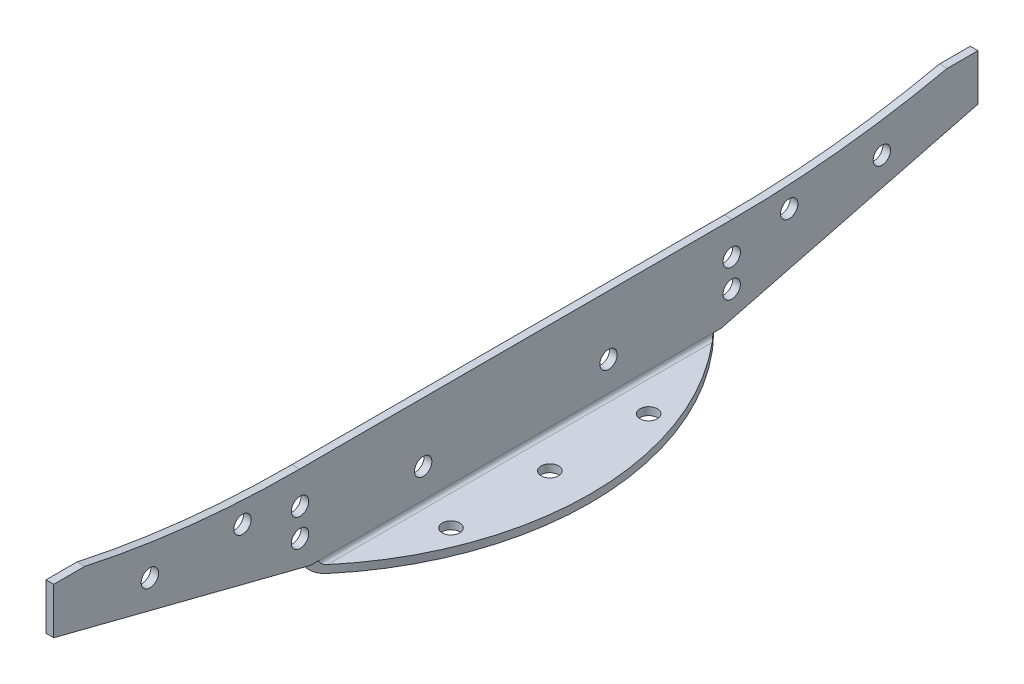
ISO-10303-21;
HEADER;
FILE_DESCRIPTION(('STEP AP214'),'2;1');
FILE_NAME('part.step','',(''),(''),'','','');
FILE_SCHEMA(('AUTOMOTIVE_DESIGN { 1 0 10303 214 1 1 1 1 }'));
ENDSEC;
DATA;
#1=APPLICATION_CONTEXT('core data for automotive mechanical design processes');
#2=APPLICATION_PROTOCOL_DEFINITION('international standard','automotive_design',2000,#1);
#3=PRODUCT_CONTEXT('',#1,'mechanical');
#4=PRODUCT('Part','Part','',(#3));
#5=PRODUCT_RELATED_PRODUCT_CATEGORY('part','',(#4));
#6=PRODUCT_DEFINITION_FORMATION('','',#4);
#7=PRODUCT_DEFINITION_CONTEXT('part definition',#1,'design');
#8=PRODUCT_DEFINITION('design','',#6,#7);
#9=PRODUCT_DEFINITION_SHAPE('','',#8);
#10=(LENGTH_UNIT() NAMED_UNIT(*) SI_UNIT(.MILLI.,.METRE.));
#11=(NAMED_UNIT(*) PLANE_ANGLE_UNIT() SI_UNIT($,.RADIAN.));
#12=(NAMED_UNIT(*) SI_UNIT($,.STERADIAN.) SOLID_ANGLE_UNIT());
#13=UNCERTAINTY_MEASURE_WITH_UNIT(LENGTH_MEASURE(1.E-05),#10,'distance_accuracy_value','');
#14=(GEOMETRIC_REPRESENTATION_CONTEXT(3) GLOBAL_UNCERTAINTY_ASSIGNED_CONTEXT((#13)) GLOBAL_UNIT_ASSIGNED_CONTEXT((#10,
#11,#12)) REPRESENTATION_CONTEXT('',''));
#15=CARTESIAN_POINT('',(0.,0.,0.));
#16=DIRECTION('',(0.,0.,1.));
#17=DIRECTION('',(1.,0.,0.));
#18=AXIS2_PLACEMENT_3D('',#15,#16,#17);
#19=CARTESIAN_POINT('',(3.17499999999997,50.8,203.2));
#20=DIRECTION('',(0.,1.,0.));
#21=DIRECTION('',(0.,0.,-1.));
#22=AXIS2_PLACEMENT_3D('',#19,#20,#21);
#23=PLANE('',#22);
#24=DIRECTION('',(1.,0.,0.));
#25=VECTOR('',#24,1.);
#26=CARTESIAN_POINT('',(0.,50.7999999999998,190.003258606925));
#27=LINE('',#26,#25);
#28=CARTESIAN_POINT('',(0.,50.7999999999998,190.003258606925));
#29=VERTEX_POINT('',#28);
#30=CARTESIAN_POINT('',(3.17499999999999,50.7999999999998,190.003258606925));
#31=VERTEX_POINT('',#30);
#32=EDGE_CURVE('E348',#29,#31,#27,.T.);
#33=ORIENTED_EDGE('',*,*,#32,.T.);
#34=DIRECTION('',(0.,0.,-1.));
#35=VECTOR('',#34,1.);
#36=CARTESIAN_POINT('',(3.17499999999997,50.8,203.2));
#37=LINE('',#36,#35);
#38=CARTESIAN_POINT('',(3.17499999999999,50.8,177.303258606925));
#39=VERTEX_POINT('',#38);
#40=EDGE_CURVE('E267',#31,#39,#37,.T.);
#41=ORIENTED_EDGE('',*,*,#40,.T.);
#42=DIRECTION('',(1.,0.,0.));
#43=VECTOR('',#42,1.);
#44=CARTESIAN_POINT('',(0.,50.8,177.303258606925));
#45=LINE('',#44,#43);
#46=CARTESIAN_POINT('',(0.,50.8,177.303258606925));
#47=VERTEX_POINT('',#46);
#48=EDGE_CURVE('E294',#47,#39,#45,.T.);
#49=ORIENTED_EDGE('',*,*,#48,.F.);
#50=DIRECTION('',(0.,0.,1.));
#51=VECTOR('',#50,1.);
#52=CARTESIAN_POINT('',(0.,50.8,203.2));
#53=LINE('',#52,#51);
#54=EDGE_CURVE('E212',#29,#47,#53,.F.);
#55=ORIENTED_EDGE('',*,*,#54,.F.);
#56=EDGE_LOOP('',(#33,#41,#49,#55));
#57=FACE_BOUND('',#56,.T.);
#58=ADVANCED_FACE('F48',(#57),#23,.T.);
#59=DIRECTION('',(1.,0.,0.));
#60=VECTOR('',#59,1.);
#61=CARTESIAN_POINT('',(0.,50.8,-190.003258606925));
#62=LINE('',#61,#60);
#63=CARTESIAN_POINT('',(0.,50.8,-190.003258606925));
#64=VERTEX_POINT('',#63);
#65=CARTESIAN_POINT('',(3.17499999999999,50.8,-190.003258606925));
#66=VERTEX_POINT('',#65);
#67=EDGE_CURVE('E179',#64,#66,#62,.T.);
#68=ORIENTED_EDGE('',*,*,#67,.F.);
#69=CARTESIAN_POINT('',(0.,50.8000000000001,-177.303258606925));
#70=VERTEX_POINT('',#69);
#71=EDGE_CURVE('E220',#70,#64,#53,.F.);
#72=ORIENTED_EDGE('',*,*,#71,.F.);
#73=DIRECTION('',(1.,0.,0.));
#74=VECTOR('',#73,1.);
#75=CARTESIAN_POINT('',(0.,50.8000000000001,-177.303258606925));
#76=LINE('',#75,#74);
#77=CARTESIAN_POINT('',(3.17499999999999,50.8000000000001,-177.303258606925));
#78=VERTEX_POINT('',#77);
#79=EDGE_CURVE('E298',#70,#78,#76,.T.);
#80=ORIENTED_EDGE('',*,*,#79,.T.);
#81=EDGE_CURVE('E217',#78,#66,#37,.T.);
#82=ORIENTED_EDGE('',*,*,#81,.T.);
#83=EDGE_LOOP('',(#68,#72,#80,#82));
#84=FACE_BOUND('',#83,.T.);
#85=ADVANCED_FACE('F50',(#84),#23,.T.);
#86=CARTESIAN_POINT('',(3.17499999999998,3.17499999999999,203.2));
#87=DIRECTION('',(0.,-1.,0.));
#88=DIRECTION('',(0.,0.,-1.));
#89=AXIS2_PLACEMENT_3D('',#86,#87,#88);
#90=PLANE('',#89);
#91=CARTESIAN_POINT('',(17.1449999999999,3.17499999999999,40.6400000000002));
#92=DIRECTION('',(0.,1.,0.));
#93=DIRECTION('',(0.,0.,1.));
#94=AXIS2_PLACEMENT_3D('',#91,#92,#93);
#95=CIRCLE('',#94,3.57187499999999);
#96=CARTESIAN_POINT('',(17.1449999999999,3.17499999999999,44.2118750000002));
#97=VERTEX_POINT('',#96);
#98=EDGE_CURVE('E394',#97,#97,#95,.T.);
#99=ORIENTED_EDGE('',*,*,#98,.F.);
#100=EDGE_LOOP('',(#99));
#101=FACE_BOUND('',#100,.T.);
#102=CARTESIAN_POINT('',(17.1449999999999,3.17499999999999,1.93317860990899E-13));
#103=DIRECTION('',(0.,1.,0.));
#104=DIRECTION('',(0.,0.,1.));
#105=AXIS2_PLACEMENT_3D('',#102,#103,#104);
#106=CIRCLE('',#105,3.57187499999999);
#107=CARTESIAN_POINT('',(17.1449999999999,3.17499999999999,3.57187500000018));
#108=VERTEX_POINT('',#107);
#109=EDGE_CURVE('E386',#108,#108,#106,.T.);
#110=ORIENTED_EDGE('',*,*,#109,.F.);
#111=EDGE_LOOP('',(#110));
#112=FACE_BOUND('',#111,.T.);
#113=CARTESIAN_POINT('',(17.1449999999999,3.17499999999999,-40.6399999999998));
#114=DIRECTION('',(0.,1.,0.));
#115=DIRECTION('',(0.,0.,1.));
#116=AXIS2_PLACEMENT_3D('',#113,#114,#115);
#117=CIRCLE('',#116,3.57187499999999);
#118=CARTESIAN_POINT('',(17.1449999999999,3.17499999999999,-37.0681249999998));
#119=VERTEX_POINT('',#118);
#120=EDGE_CURVE('E378',#119,#119,#117,.T.);
#121=ORIENTED_EDGE('',*,*,#120,.F.);
#122=EDGE_LOOP('',(#121));
#123=FACE_BOUND('',#122,.T.);
#124=DIRECTION('',(0.,0.,-1.));
#125=VECTOR('',#124,1.);
#126=CARTESIAN_POINT('',(4.76249999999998,3.17499999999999,203.2));
#127=LINE('',#126,#125);
#128=CARTESIAN_POINT('',(4.76249999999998,3.17499999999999,-79.1367969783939));
#129=VERTEX_POINT('',#128);
#130=CARTESIAN_POINT('',(4.76249999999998,3.175,79.1367969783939));
#131=VERTEX_POINT('',#130);
#132=EDGE_CURVE('E227',#129,#131,#127,.F.);
#133=ORIENTED_EDGE('',*,*,#132,.T.);
#134=CARTESIAN_POINT('',(-88.9,3.17499999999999,0.));
#135=DIRECTION('',(0.,-1.,0.));
#136=DIRECTION('',(0.,0.,-1.));
#137=AXIS2_PLACEMENT_3D('',#134,#135,#136);
#138=CIRCLE('',#137,122.618499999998);
#139=EDGE_CURVE('E251',#131,#129,#138,.F.);
#140=ORIENTED_EDGE('',*,*,#139,.T.);
#141=EDGE_LOOP('',(#133,#140));
#142=FACE_BOUND('',#141,.T.);
#143=ADVANCED_FACE('F259',(#101,#112,#123,#142),#90,.F.);
#144=CARTESIAN_POINT('',(3.17499999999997,50.8,203.2));
#145=DIRECTION('',(-1.,0.,0.));
#146=DIRECTION('',(0.,-1.,0.));
#147=AXIS2_PLACEMENT_3D('',#144,#145,#146);
#148=PLANE('',#147);
#149=CARTESIAN_POINT('',(3.17499999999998,16.8275,-38.0999999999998));
#150=DIRECTION('',(1.,0.,0.));
#151=DIRECTION('',(0.,0.,-1.));
#152=AXIS2_PLACEMENT_3D('',#149,#150,#151);
#153=CIRCLE('',#152,3.571875);
#154=CARTESIAN_POINT('',(3.17499999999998,16.8275,-41.6718749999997));
#155=VERTEX_POINT('',#154);
#156=EDGE_CURVE('E469',#155,#155,#153,.T.);
#157=ORIENTED_EDGE('',*,*,#156,.F.);
#158=EDGE_LOOP('',(#157));
#159=FACE_BOUND('',#158,.T.);
#160=CARTESIAN_POINT('',(3.17499999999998,16.8275,38.1000000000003));
#161=DIRECTION('',(1.,0.,0.));
#162=DIRECTION('',(0.,0.,-1.));
#163=AXIS2_PLACEMENT_3D('',#160,#161,#162);
#164=CIRCLE('',#163,3.571875);
#165=CARTESIAN_POINT('',(3.17499999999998,16.8275,34.5281250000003));
#166=VERTEX_POINT('',#165);
#167=EDGE_CURVE('E461',#166,#166,#164,.T.);
#168=ORIENTED_EDGE('',*,*,#167,.F.);
#169=EDGE_LOOP('',(#168));
#170=FACE_BOUND('',#169,.T.);
#171=CARTESIAN_POINT('',(3.17499999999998,33.3375,-112.385553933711));
#172=DIRECTION('',(1.,0.,0.));
#173=DIRECTION('',(0.,0.,-1.));
#174=AXIS2_PLACEMENT_3D('',#171,#172,#173);
#175=CIRCLE('',#174,3.571875);
#176=CARTESIAN_POINT('',(3.17499999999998,33.3375,-115.957428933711));
#177=VERTEX_POINT('',#176);
#178=EDGE_CURVE('E454',#177,#177,#175,.T.);
#179=ORIENTED_EDGE('',*,*,#178,.F.);
#180=EDGE_LOOP('',(#179));
#181=FACE_BOUND('',#180,.T.);
#182=CARTESIAN_POINT('',(3.17499999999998,33.3375,-150.485553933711));
#183=DIRECTION('',(1.,0.,0.));
#184=DIRECTION('',(0.,0.,-1.));
#185=AXIS2_PLACEMENT_3D('',#182,#183,#184);
#186=CIRCLE('',#185,3.571875);
#187=CARTESIAN_POINT('',(3.17499999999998,33.3375,-154.057428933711));
#188=VERTEX_POINT('',#187);
#189=EDGE_CURVE('E447',#188,#188,#186,.T.);
#190=ORIENTED_EDGE('',*,*,#189,.F.);
#191=EDGE_LOOP('',(#190));
#192=FACE_BOUND('',#191,.T.);
#193=CARTESIAN_POINT('',(3.17499999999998,33.3375000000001,112.385553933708));
#194=DIRECTION('',(1.,0.,0.));
#195=DIRECTION('',(0.,0.,-1.));
#196=AXIS2_PLACEMENT_3D('',#193,#194,#195);
#197=CIRCLE('',#196,3.571875);
#198=CARTESIAN_POINT('',(3.17499999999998,33.3375000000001,108.813678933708));
#199=VERTEX_POINT('',#198);
#200=EDGE_CURVE('E440',#199,#199,#197,.T.);
#201=ORIENTED_EDGE('',*,*,#200,.F.);
#202=EDGE_LOOP('',(#201));
#203=FACE_BOUND('',#202,.T.);
#204=CARTESIAN_POINT('',(3.17499999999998,33.3375000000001,150.485553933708));
#205=DIRECTION('',(1.,0.,0.));
#206=DIRECTION('',(0.,0.,-1.));
#207=AXIS2_PLACEMENT_3D('',#204,#205,#206);
#208=CIRCLE('',#207,3.571875);
#209=CARTESIAN_POINT('',(3.17499999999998,33.3375000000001,146.913678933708));
#210=VERTEX_POINT('',#209);
#211=EDGE_CURVE('E432',#210,#210,#208,.T.);
#212=ORIENTED_EDGE('',*,*,#211,.F.);
#213=EDGE_LOOP('',(#212));
#214=FACE_BOUND('',#213,.T.);
#215=CARTESIAN_POINT('',(3.17499999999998,16.5100000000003,88.7412500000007));
#216=DIRECTION('',(1.,0.,0.));
#217=DIRECTION('',(0.,0.,-1.));
#218=AXIS2_PLACEMENT_3D('',#215,#216,#217);
#219=CIRCLE('',#218,3.571875);
#220=CARTESIAN_POINT('',(3.17499999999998,16.5100000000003,85.1693750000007));
#221=VERTEX_POINT('',#220);
#222=EDGE_CURVE('E425',#221,#221,#219,.T.);
#223=ORIENTED_EDGE('',*,*,#222,.F.);
#224=EDGE_LOOP('',(#223));
#225=FACE_BOUND('',#224,.T.);
#226=CARTESIAN_POINT('',(3.17499999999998,27.9400000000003,88.7412500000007));
#227=DIRECTION('',(1.,0.,0.));
#228=DIRECTION('',(0.,0.,-1.));
#229=AXIS2_PLACEMENT_3D('',#226,#227,#228);
#230=CIRCLE('',#229,3.571875);
#231=CARTESIAN_POINT('',(3.17499999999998,27.9400000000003,85.1693750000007));
#232=VERTEX_POINT('',#231);
#233=EDGE_CURVE('E417',#232,#232,#230,.T.);
#234=ORIENTED_EDGE('',*,*,#233,.F.);
#235=EDGE_LOOP('',(#234));
#236=FACE_BOUND('',#235,.T.);
#237=CARTESIAN_POINT('',(3.17499999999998,16.5100000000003,-88.7412499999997));
#238=DIRECTION('',(1.,0.,0.));
#239=DIRECTION('',(0.,0.,-1.));
#240=AXIS2_PLACEMENT_3D('',#237,#238,#239);
#241=CIRCLE('',#240,3.571875);
#242=CARTESIAN_POINT('',(3.17499999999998,16.5100000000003,-92.3131249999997));
#243=VERTEX_POINT('',#242);
#244=EDGE_CURVE('E410',#243,#243,#241,.T.);
#245=ORIENTED_EDGE('',*,*,#244,.F.);
#246=EDGE_LOOP('',(#245));
#247=FACE_BOUND('',#246,.T.);
#248=CARTESIAN_POINT('',(3.17499999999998,27.9400000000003,-88.7412499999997));
#249=DIRECTION('',(1.,0.,0.));
#250=DIRECTION('',(0.,0.,-1.));
#251=AXIS2_PLACEMENT_3D('',#248,#249,#250);
#252=CIRCLE('',#251,3.571875);
#253=CARTESIAN_POINT('',(3.17499999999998,27.9400000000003,-92.3131249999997));
#254=VERTEX_POINT('',#253);
#255=EDGE_CURVE('E402',#254,#254,#252,.T.);
#256=ORIENTED_EDGE('',*,*,#255,.F.);
#257=EDGE_LOOP('',(#256));
#258=FACE_BOUND('',#257,.T.);
#259=DIRECTION('',(0.,0.,1.));
#260=VECTOR('',#259,1.);
#261=CARTESIAN_POINT('',(3.17499999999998,4.7625,203.2));
#262=LINE('',#261,#260);
#263=CARTESIAN_POINT('',(3.17499999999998,4.7625,-84.4516817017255));
#264=VERTEX_POINT('',#263);
#265=CARTESIAN_POINT('',(3.17499999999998,4.7625,-80.9783360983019));
#266=VERTEX_POINT('',#265);
#267=EDGE_CURVE('E204',#264,#266,#262,.T.);
#268=ORIENTED_EDGE('',*,*,#267,.F.);
#269=DIRECTION('',(0.,-0.247712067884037,0.968833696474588));
#270=VECTOR('',#269,1.);
#271=CARTESIAN_POINT('',(3.17499999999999,31.75,-190.003258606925));
#272=LINE('',#271,#270);
#273=CARTESIAN_POINT('',(3.17499999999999,31.75,-190.003258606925));
#274=VERTEX_POINT('',#273);
#275=EDGE_CURVE('E71',#274,#264,#272,.T.);
#276=ORIENTED_EDGE('',*,*,#275,.F.);
#277=DIRECTION('',(0.,-1.,0.));
#278=VECTOR('',#277,1.);
#279=CARTESIAN_POINT('',(3.17499999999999,50.8,-190.003258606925));
#280=LINE('',#279,#278);
#281=EDGE_CURVE('E190',#66,#274,#280,.T.);
#282=ORIENTED_EDGE('',*,*,#281,.F.);
#283=ORIENTED_EDGE('',*,*,#81,.F.);
#284=CARTESIAN_POINT('',(3.17500000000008,456.28086652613,-88.9));
#285=DIRECTION('',(1.,0.,0.));
#286=DIRECTION('',(0.,1.,0.));
#287=AXIS2_PLACEMENT_3D('',#284,#285,#286);
#288=CIRCLE('',#287,415.00586652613);
#289=CARTESIAN_POINT('',(3.17499999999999,41.275,-88.9));
#290=VERTEX_POINT('',#289);
#291=EDGE_CURVE('E312',#290,#78,#288,.T.);
#292=ORIENTED_EDGE('',*,*,#291,.F.);
#293=DIRECTION('',(0.,0.,-1.));
#294=VECTOR('',#293,1.);
#295=CARTESIAN_POINT('',(3.17499999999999,41.275,88.9));
#296=LINE('',#295,#294);
#297=CARTESIAN_POINT('',(3.17499999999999,41.275,88.9));
#298=VERTEX_POINT('',#297);
#299=EDGE_CURVE('E336',#298,#290,#296,.T.);
#300=ORIENTED_EDGE('',*,*,#299,.F.);
#301=CARTESIAN_POINT('',(3.17500000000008,456.28086652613,88.9));
#302=DIRECTION('',(1.,0.,0.));
#303=DIRECTION('',(0.,-1.,0.));
#304=AXIS2_PLACEMENT_3D('',#301,#302,#303);
#305=CIRCLE('',#304,415.00586652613);
#306=EDGE_CURVE('E334',#39,#298,#305,.T.);
#307=ORIENTED_EDGE('',*,*,#306,.F.);
#308=ORIENTED_EDGE('',*,*,#40,.F.);
#309=DIRECTION('',(0.,1.,0.));
#310=VECTOR('',#309,1.);
#311=CARTESIAN_POINT('',(3.17499999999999,50.7999999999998,190.003258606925));
#312=LINE('',#311,#310);
#313=CARTESIAN_POINT('',(3.17499999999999,31.75,190.003258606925));
#314=VERTEX_POINT('',#313);
#315=EDGE_CURVE('E352',#314,#31,#312,.T.);
#316=ORIENTED_EDGE('',*,*,#315,.F.);
#317=DIRECTION('',(0.,0.247712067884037,0.968833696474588));
#318=VECTOR('',#317,1.);
#319=CARTESIAN_POINT('',(3.17499999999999,31.75,190.003258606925));
#320=LINE('',#319,#318);
#321=CARTESIAN_POINT('',(3.17499999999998,4.76249999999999,84.4516817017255));
#322=VERTEX_POINT('',#321);
#323=EDGE_CURVE('E356',#322,#314,#320,.T.);
#324=ORIENTED_EDGE('',*,*,#323,.F.);
#325=DIRECTION('',(0.,0.,-1.));
#326=VECTOR('',#325,1.);
#327=CARTESIAN_POINT('',(3.17499999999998,4.7625,-203.2));
#328=LINE('',#327,#326);
#329=CARTESIAN_POINT('',(3.17499999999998,4.7625,80.9783360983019));
#330=VERTEX_POINT('',#329);
#331=EDGE_CURVE('E271',#322,#330,#328,.T.);
#332=ORIENTED_EDGE('',*,*,#331,.T.);
#333=EDGE_CURVE('E270',#330,#266,#328,.T.);
#334=ORIENTED_EDGE('',*,*,#333,.T.);
#335=EDGE_LOOP('',(#268,#276,#282,#283,#292,#300,#307,#308,#316,#324,#332,#334));
#336=FACE_BOUND('',#335,.T.);
#337=ADVANCED_FACE('F235',(#159,#170,#181,#192,#203,#214,#225,#236,#247,#258,#336),#148,.F.);
#338=CARTESIAN_POINT('',(4.76249999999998,4.7625,203.2));
#339=DIRECTION('',(0.,0.,1.));
#340=DIRECTION('',(1.,0.,0.));
#341=AXIS2_PLACEMENT_3D('',#338,#339,#340);
#342=CYLINDRICAL_SURFACE('',#341,1.5875);
#343=ORIENTED_EDGE('',*,*,#132,.F.);
#344=CARTESIAN_POINT('',(4.76249999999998,3.175,-79.1367969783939));
#345=CARTESIAN_POINT('',(4.69672945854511,3.17503129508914,-79.2146418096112));
#346=CARTESIAN_POINT('',(4.63084258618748,3.17909000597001,-79.2924235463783));
#347=CARTESIAN_POINT('',(4.49916281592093,3.19557597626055,-79.4474871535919));
#348=CARTESIAN_POINT('',(4.43337050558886,3.20802293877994,-79.5247674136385));
#349=CARTESIAN_POINT('',(4.30173044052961,3.24180470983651,-79.6790085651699));
#350=CARTESIAN_POINT('',(4.23589162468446,3.26324511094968,-79.755954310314));
#351=CARTESIAN_POINT('',(4.10569550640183,3.31554393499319,-79.9077413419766));
#352=CARTESIAN_POINT('',(4.04133661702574,3.34639171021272,-79.9825849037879));
#353=CARTESIAN_POINT('',(3.90546239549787,3.42360815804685,-80.1402211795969));
#354=CARTESIAN_POINT('',(3.83430520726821,3.47160227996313,-80.2225419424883));
#355=CARTESIAN_POINT('',(3.69705841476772,3.58235763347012,-80.3809195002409));
#356=CARTESIAN_POINT('',(3.63095218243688,3.64506737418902,-80.4569969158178));
#357=CARTESIAN_POINT('',(3.52185707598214,3.76951238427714,-80.5822685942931));
#358=CARTESIAN_POINT('',(3.47717575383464,3.82771174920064,-80.633479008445));
#359=CARTESIAN_POINT('',(3.39420245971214,3.95403942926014,-80.7284379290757));
#360=CARTESIAN_POINT('',(3.35590348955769,4.02215671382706,-80.772194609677));
#361=CARTESIAN_POINT('',(3.29635715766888,4.15067415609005,-80.840149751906));
#362=CARTESIAN_POINT('',(3.27322152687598,4.20904002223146,-80.866523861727));
#363=CARTESIAN_POINT('',(3.23353563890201,4.33065024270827,-80.9117362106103));
#364=CARTESIAN_POINT('',(3.21696887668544,4.39388188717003,-80.9305933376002));
#365=CARTESIAN_POINT('',(3.1947408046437,4.50797029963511,-80.9558860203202));
#366=CARTESIAN_POINT('',(3.18740481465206,4.55808152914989,-80.964229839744));
#367=CARTESIAN_POINT('',(3.17750306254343,4.6596024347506,-80.9754900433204));
#368=CARTESIAN_POINT('',(3.17495952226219,4.71101704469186,-80.9783811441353));
#369=CARTESIAN_POINT('',(3.17499999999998,4.7625,-80.9783360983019));
#370=B_SPLINE_CURVE_WITH_KNOTS('',3,(#344,#345,#346,#347,#348,#349,#350,#351,#352,#353,#354,
#355,#356,#357,#358,#359,#360,#361,#362,#363,#364,#365,#366,#367,#368,#369),.UNSPECIFIED.,.F.,
.F.,(4,2,2,2,2,2,2,2,2,2,2,2,4),(0.,0.30569055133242,0.612101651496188,0.922215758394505,
1.23198015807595,1.58778643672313,1.94236581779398,2.20994823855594,2.47723529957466,
2.6807726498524,2.8837952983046,3.03727548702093,3.19146560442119),.UNSPECIFIED.);
#371=EDGE_CURVE('E261',#129,#266,#370,.T.);
#372=ORIENTED_EDGE('',*,*,#371,.T.);
#373=ORIENTED_EDGE('',*,*,#333,.F.);
#374=CARTESIAN_POINT('',(3.17499999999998,4.7625,80.9783360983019));
#375=CARTESIAN_POINT('',(3.1749906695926,4.7282828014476,80.9783464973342));
#376=CARTESIAN_POINT('',(3.17610594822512,4.69407344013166,80.9770785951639));
#377=CARTESIAN_POINT('',(3.18051371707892,4.62600933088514,80.9720665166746));
#378=CARTESIAN_POINT('',(3.18380415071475,4.59215427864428,80.968324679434));
#379=CARTESIAN_POINT('',(3.19244835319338,4.52539722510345,80.958492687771));
#380=CARTESIAN_POINT('',(3.19778180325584,4.49248916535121,80.952425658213));
#381=CARTESIAN_POINT('',(3.21038680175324,4.42754219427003,80.9380829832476));
#382=CARTESIAN_POINT('',(3.21765869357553,4.39550343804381,80.9298069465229));
#383=CARTESIAN_POINT('',(3.24210698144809,4.30124873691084,80.9019732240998));
#384=CARTESIAN_POINT('',(3.26195730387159,4.24059074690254,80.8793629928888));
#385=CARTESIAN_POINT('',(3.30749873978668,4.12450191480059,80.8274391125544));
#386=CARTESIAN_POINT('',(3.33320508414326,4.06908524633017,80.7981079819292));
#387=CARTESIAN_POINT('',(3.40220631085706,3.93947671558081,80.7192857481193));
#388=CARTESIAN_POINT('',(3.44812355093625,3.86852626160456,80.6667600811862));
#389=CARTESIAN_POINT('',(3.54661109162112,3.73856281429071,80.553872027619));
#390=CARTESIAN_POINT('',(3.59919393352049,3.67957288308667,80.4934948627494));
#391=CARTESIAN_POINT('',(3.73522748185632,3.54687130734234,80.3369553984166));
#392=CARTESIAN_POINT('',(3.82135154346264,3.47974452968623,80.2375589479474));
#393=CARTESIAN_POINT('',(3.99910759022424,3.3666055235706,80.0316873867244));
#394=CARTESIAN_POINT('',(4.0907558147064,3.32065936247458,79.9251912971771));
#395=CARTESIAN_POINT('',(4.23136616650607,3.26561657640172,79.7612096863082));
#396=CARTESIAN_POINT('',(4.27935954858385,3.24947475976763,79.7051379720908));
#397=CARTESIAN_POINT('',(4.37583442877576,3.22199245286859,79.5922154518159));
#398=CARTESIAN_POINT('',(4.42431599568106,3.21065264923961,79.53536453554));
#399=CARTESIAN_POINT('',(4.52107036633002,3.19270143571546,79.4216952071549));
#400=CARTESIAN_POINT('',(4.56934079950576,3.18604626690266,79.3648815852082));
#401=CARTESIAN_POINT('',(4.66592603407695,3.17720110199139,79.2509912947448));
#402=CARTESIAN_POINT('',(4.71424080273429,3.17500894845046,79.1939147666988));
#403=CARTESIAN_POINT('',(4.76249999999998,3.175,79.1367969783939));
#404=B_SPLINE_CURVE_WITH_KNOTS('',3,(#374,#375,#376,#377,#378,#379,#380,#381,#382,#383,#384,
#385,#386,#387,#388,#389,#390,#391,#392,#393,#394,#395,#396,#397,#398,#399,#400,#401,#402,#403),
.UNSPECIFIED.,.F.,.F.,(4,2,2,2,2,2,2,2,2,2,2,2,2,2,4),(0.,0.102597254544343,0.205097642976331,
0.306604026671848,0.408128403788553,0.610260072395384,0.812923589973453,1.10976006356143,
1.40716356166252,1.84774573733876,2.28969304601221,2.51621524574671,2.74276982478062,
2.96717903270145,3.19147973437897),.UNSPECIFIED.);
#405=EDGE_CURVE('E242',#330,#131,#404,.T.);
#406=ORIENTED_EDGE('',*,*,#405,.T.);
#407=EDGE_LOOP('',(#343,#372,#373,#406));
#408=FACE_BOUND('',#407,.T.);
#409=ADVANCED_FACE('F253',(#408),#342,.F.);
#410=CARTESIAN_POINT('',(3.17499999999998,0.,203.2));
#411=DIRECTION('',(0.,-1.,0.));
#412=DIRECTION('',(0.,0.,-1.));
#413=AXIS2_PLACEMENT_3D('',#410,#411,#412);
#414=PLANE('',#413);
#415=CARTESIAN_POINT('',(17.1449999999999,0.,40.6400000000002));
#416=DIRECTION('',(0.,1.,0.));
#417=DIRECTION('',(0.,0.,1.));
#418=AXIS2_PLACEMENT_3D('',#415,#416,#417);
#419=CIRCLE('',#418,3.571875);
#420=CARTESIAN_POINT('',(17.1449999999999,0.,44.2118750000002));
#421=VERTEX_POINT('',#420);
#422=EDGE_CURVE('E390',#421,#421,#419,.T.);
#423=ORIENTED_EDGE('',*,*,#422,.T.);
#424=EDGE_LOOP('',(#423));
#425=FACE_BOUND('',#424,.T.);
#426=CARTESIAN_POINT('',(17.1449999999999,0.,1.93317860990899E-13));
#427=DIRECTION('',(0.,1.,0.));
#428=DIRECTION('',(0.,0.,1.));
#429=AXIS2_PLACEMENT_3D('',#426,#427,#428);
#430=CIRCLE('',#429,3.571875);
#431=CARTESIAN_POINT('',(17.1449999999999,0.,3.57187500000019));
#432=VERTEX_POINT('',#431);
#433=EDGE_CURVE('E382',#432,#432,#430,.T.);
#434=ORIENTED_EDGE('',*,*,#433,.T.);
#435=EDGE_LOOP('',(#434));
#436=FACE_BOUND('',#435,.T.);
#437=CARTESIAN_POINT('',(17.1449999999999,0.,-40.6399999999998));
#438=DIRECTION('',(0.,1.,0.));
#439=DIRECTION('',(0.,0.,1.));
#440=AXIS2_PLACEMENT_3D('',#437,#438,#439);
#441=CIRCLE('',#440,3.571875);
#442=CARTESIAN_POINT('',(17.1449999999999,0.,-37.0681249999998));
#443=VERTEX_POINT('',#442);
#444=EDGE_CURVE('E360',#443,#443,#441,.T.);
#445=ORIENTED_EDGE('',*,*,#444,.T.);
#446=EDGE_LOOP('',(#445));
#447=FACE_BOUND('',#446,.T.);
#448=CARTESIAN_POINT('',(-88.9,0.,0.));
#449=DIRECTION('',(0.,1.,0.));
#450=DIRECTION('',(0.,0.,-1.));
#451=AXIS2_PLACEMENT_3D('',#448,#449,#450);
#452=CIRCLE('',#451,122.618499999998);
#453=CARTESIAN_POINT('',(4.76249999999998,0.,79.1367969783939));
#454=VERTEX_POINT('',#453);
#455=CARTESIAN_POINT('',(4.76249999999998,0.,-79.1367969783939));
#456=VERTEX_POINT('',#455);
#457=EDGE_CURVE('E199',#454,#456,#452,.T.);
#458=ORIENTED_EDGE('',*,*,#457,.F.);
#459=DIRECTION('',(0.,0.,-1.));
#460=VECTOR('',#459,1.);
#461=CARTESIAN_POINT('',(4.76249999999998,0.,203.2));
#462=LINE('',#461,#460);
#463=EDGE_CURVE('E211',#456,#454,#462,.F.);
#464=ORIENTED_EDGE('',*,*,#463,.F.);
#465=EDGE_LOOP('',(#458,#464));
#466=FACE_BOUND('',#465,.T.);
#467=ADVANCED_FACE('F257',(#425,#436,#447,#466),#414,.T.);
#468=CARTESIAN_POINT('',(0.,50.8,203.2));
#469=DIRECTION('',(-1.,0.,0.));
#470=DIRECTION('',(0.,-1.,0.));
#471=AXIS2_PLACEMENT_3D('',#468,#469,#470);
#472=PLANE('',#471);
#473=CARTESIAN_POINT('',(-1.08853898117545E-13,16.8275,-38.0999999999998));
#474=DIRECTION('',(1.,0.,0.));
#475=DIRECTION('',(0.,0.,-1.));
#476=AXIS2_PLACEMENT_3D('',#473,#474,#475);
#477=CIRCLE('',#476,3.571875);
#478=CARTESIAN_POINT('',(-1.08853898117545E-13,16.8275,-41.6718749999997));
#479=VERTEX_POINT('',#478);
#480=EDGE_CURVE('E465',#479,#479,#477,.T.);
#481=ORIENTED_EDGE('',*,*,#480,.T.);
#482=EDGE_LOOP('',(#481));
#483=FACE_BOUND('',#482,.T.);
#484=CARTESIAN_POINT('',(-1.08853898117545E-13,16.8275,38.1000000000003));
#485=DIRECTION('',(1.,0.,0.));
#486=DIRECTION('',(0.,0.,-1.));
#487=AXIS2_PLACEMENT_3D('',#484,#485,#486);
#488=CIRCLE('',#487,3.571875);
#489=CARTESIAN_POINT('',(-1.08853898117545E-13,16.8275,34.5281250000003));
#490=VERTEX_POINT('',#489);
#491=EDGE_CURVE('E457',#490,#490,#488,.T.);
#492=ORIENTED_EDGE('',*,*,#491,.T.);
#493=EDGE_LOOP('',(#492));
#494=FACE_BOUND('',#493,.T.);
#495=CARTESIAN_POINT('',(-1.10588621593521E-13,33.3375,-112.385553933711));
#496=DIRECTION('',(1.,0.,0.));
#497=DIRECTION('',(0.,0.,-1.));
#498=AXIS2_PLACEMENT_3D('',#495,#496,#497);
#499=CIRCLE('',#498,3.571875);
#500=CARTESIAN_POINT('',(-1.10588621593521E-13,33.3375,-115.957428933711));
#501=VERTEX_POINT('',#500);
#502=EDGE_CURVE('E451',#501,#501,#499,.T.);
#503=ORIENTED_EDGE('',*,*,#502,.T.);
#504=EDGE_LOOP('',(#503));
#505=FACE_BOUND('',#504,.T.);
#506=CARTESIAN_POINT('',(-1.10588621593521E-13,33.3375,-150.485553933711));
#507=DIRECTION('',(1.,0.,0.));
#508=DIRECTION('',(0.,0.,-1.));
#509=AXIS2_PLACEMENT_3D('',#506,#507,#508);
#510=CIRCLE('',#509,3.571875);
#511=CARTESIAN_POINT('',(-1.10588621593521E-13,33.3375,-154.057428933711));
#512=VERTEX_POINT('',#511);
#513=EDGE_CURVE('E443',#512,#512,#510,.T.);
#514=ORIENTED_EDGE('',*,*,#513,.T.);
#515=EDGE_LOOP('',(#514));
#516=FACE_BOUND('',#515,.T.);
#517=CARTESIAN_POINT('',(-1.10588621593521E-13,33.3375000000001,112.385553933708));
#518=DIRECTION('',(1.,0.,0.));
#519=DIRECTION('',(0.,0.,-1.));
#520=AXIS2_PLACEMENT_3D('',#517,#518,#519);
#521=CIRCLE('',#520,3.571875);
#522=CARTESIAN_POINT('',(-1.10588621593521E-13,33.3375000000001,108.813678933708));
#523=VERTEX_POINT('',#522);
#524=EDGE_CURVE('E436',#523,#523,#521,.T.);
#525=ORIENTED_EDGE('',*,*,#524,.T.);
#526=EDGE_LOOP('',(#525));
#527=FACE_BOUND('',#526,.T.);
#528=CARTESIAN_POINT('',(-1.10588621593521E-13,33.3375000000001,150.485553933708));
#529=DIRECTION('',(1.,0.,0.));
#530=DIRECTION('',(0.,0.,-1.));
#531=AXIS2_PLACEMENT_3D('',#528,#529,#530);
#532=CIRCLE('',#531,3.571875);
#533=CARTESIAN_POINT('',(-1.10588621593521E-13,33.3375000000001,146.913678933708));
#534=VERTEX_POINT('',#533);
#535=EDGE_CURVE('E429',#534,#534,#532,.T.);
#536=ORIENTED_EDGE('',*,*,#535,.T.);
#537=EDGE_LOOP('',(#536));
#538=FACE_BOUND('',#537,.T.);
#539=CARTESIAN_POINT('',(-1.08853898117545E-13,16.5100000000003,88.7412500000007));
#540=DIRECTION('',(1.,0.,0.));
#541=DIRECTION('',(0.,0.,-1.));
#542=AXIS2_PLACEMENT_3D('',#539,#540,#541);
#543=CIRCLE('',#542,3.571875);
#544=CARTESIAN_POINT('',(-1.08853898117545E-13,16.5100000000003,85.1693750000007));
#545=VERTEX_POINT('',#544);
#546=EDGE_CURVE('E421',#545,#545,#543,.T.);
#547=ORIENTED_EDGE('',*,*,#546,.T.);
#548=EDGE_LOOP('',(#547));
#549=FACE_BOUND('',#548,.T.);
#550=CARTESIAN_POINT('',(-1.10154940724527E-13,27.9400000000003,88.7412500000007));
#551=DIRECTION('',(1.,0.,0.));
#552=DIRECTION('',(0.,0.,-1.));
#553=AXIS2_PLACEMENT_3D('',#550,#551,#552);
#554=CIRCLE('',#553,3.571875);
#555=CARTESIAN_POINT('',(-1.10154940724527E-13,27.9400000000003,85.1693750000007));
#556=VERTEX_POINT('',#555);
#557=EDGE_CURVE('E414',#556,#556,#554,.T.);
#558=ORIENTED_EDGE('',*,*,#557,.T.);
#559=EDGE_LOOP('',(#558));
#560=FACE_BOUND('',#559,.T.);
#561=CARTESIAN_POINT('',(-1.08853898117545E-13,16.5100000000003,-88.7412499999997));
#562=DIRECTION('',(1.,0.,0.));
#563=DIRECTION('',(0.,0.,-1.));
#564=AXIS2_PLACEMENT_3D('',#561,#562,#563);
#565=CIRCLE('',#564,3.571875);
#566=CARTESIAN_POINT('',(-1.08853898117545E-13,16.5100000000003,-92.3131249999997));
#567=VERTEX_POINT('',#566);
#568=EDGE_CURVE('E406',#567,#567,#565,.T.);
#569=ORIENTED_EDGE('',*,*,#568,.T.);
#570=EDGE_LOOP('',(#569));
#571=FACE_BOUND('',#570,.T.);
#572=CARTESIAN_POINT('',(-1.10154940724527E-13,27.9400000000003,-88.7412499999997));
#573=DIRECTION('',(1.,0.,0.));
#574=DIRECTION('',(0.,0.,-1.));
#575=AXIS2_PLACEMENT_3D('',#572,#573,#574);
#576=CIRCLE('',#575,3.571875);
#577=CARTESIAN_POINT('',(-1.10154940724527E-13,27.9400000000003,-92.3131249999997));
#578=VERTEX_POINT('',#577);
#579=EDGE_CURVE('E398',#578,#578,#576,.T.);
#580=ORIENTED_EDGE('',*,*,#579,.T.);
#581=EDGE_LOOP('',(#580));
#582=FACE_BOUND('',#581,.T.);
#583=DIRECTION('',(0.,-0.247712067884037,0.968833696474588));
#584=VECTOR('',#583,1.);
#585=CARTESIAN_POINT('',(0.,31.75,-190.003258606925));
#586=LINE('',#585,#584);
#587=CARTESIAN_POINT('',(0.,31.75,-190.003258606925));
#588=VERTEX_POINT('',#587);
#589=CARTESIAN_POINT('',(0.,4.7625,-84.4516817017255));
#590=VERTEX_POINT('',#589);
#591=EDGE_CURVE('E173',#588,#590,#586,.T.);
#592=ORIENTED_EDGE('',*,*,#591,.T.);
#593=DIRECTION('',(0.,0.,1.));
#594=VECTOR('',#593,1.);
#595=CARTESIAN_POINT('',(0.,4.7625,203.2));
#596=LINE('',#595,#594);
#597=CARTESIAN_POINT('',(0.,4.7625,84.4516817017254));
#598=VERTEX_POINT('',#597);
#599=EDGE_CURVE('E187',#598,#590,#596,.F.);
#600=ORIENTED_EDGE('',*,*,#599,.F.);
#601=DIRECTION('',(0.,0.247712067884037,0.968833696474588));
#602=VECTOR('',#601,1.);
#603=CARTESIAN_POINT('',(0.,31.75,190.003258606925));
#604=LINE('',#603,#602);
#605=CARTESIAN_POINT('',(0.,31.75,190.003258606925));
#606=VERTEX_POINT('',#605);
#607=EDGE_CURVE('E355',#598,#606,#604,.T.);
#608=ORIENTED_EDGE('',*,*,#607,.T.);
#609=DIRECTION('',(0.,1.,0.));
#610=VECTOR('',#609,1.);
#611=CARTESIAN_POINT('',(0.,50.7999999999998,190.003258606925));
#612=LINE('',#611,#610);
#613=EDGE_CURVE('E345',#606,#29,#612,.T.);
#614=ORIENTED_EDGE('',*,*,#613,.T.);
#615=ORIENTED_EDGE('',*,*,#54,.T.);
#616=CARTESIAN_POINT('',(0.,456.28086652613,88.9));
#617=DIRECTION('',(1.,0.,0.));
#618=DIRECTION('',(0.,-1.,0.));
#619=AXIS2_PLACEMENT_3D('',#616,#617,#618);
#620=CIRCLE('',#619,415.00586652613);
#621=CARTESIAN_POINT('',(0.,41.275,88.9));
#622=VERTEX_POINT('',#621);
#623=EDGE_CURVE('E330',#47,#622,#620,.T.);
#624=ORIENTED_EDGE('',*,*,#623,.T.);
#625=DIRECTION('',(0.,0.,-1.));
#626=VECTOR('',#625,1.);
#627=CARTESIAN_POINT('',(0.,41.275,88.9));
#628=LINE('',#627,#626);
#629=CARTESIAN_POINT('',(0.,41.275,-88.9));
#630=VERTEX_POINT('',#629);
#631=EDGE_CURVE('E324',#622,#630,#628,.T.);
#632=ORIENTED_EDGE('',*,*,#631,.T.);
#633=CARTESIAN_POINT('',(0.,456.28086652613,-88.9));
#634=DIRECTION('',(1.,0.,0.));
#635=DIRECTION('',(0.,1.,0.));
#636=AXIS2_PLACEMENT_3D('',#633,#634,#635);
#637=CIRCLE('',#636,415.00586652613);
#638=EDGE_CURVE('E82',#630,#70,#637,.T.);
#639=ORIENTED_EDGE('',*,*,#638,.T.);
#640=ORIENTED_EDGE('',*,*,#71,.T.);
#641=DIRECTION('',(0.,-1.,0.));
#642=VECTOR('',#641,1.);
#643=CARTESIAN_POINT('',(0.,50.8,-190.003258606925));
#644=LINE('',#643,#642);
#645=EDGE_CURVE('E180',#64,#588,#644,.T.);
#646=ORIENTED_EDGE('',*,*,#645,.T.);
#647=EDGE_LOOP('',(#592,#600,#608,#614,#615,#624,#632,#639,#640,#646));
#648=FACE_BOUND('',#647,.T.);
#649=ADVANCED_FACE('F184',(#483,#494,#505,#516,#527,#538,#549,#560,#571,#582,#648),#472,.T.);
#650=CARTESIAN_POINT('',(4.76249999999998,4.7625,203.2));
#651=DIRECTION('',(0.,0.,1.));
#652=DIRECTION('',(1.,0.,0.));
#653=AXIS2_PLACEMENT_3D('',#650,#651,#652);
#654=CYLINDRICAL_SURFACE('',#653,4.7625);
#655=CARTESIAN_POINT('',(4.76249999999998,0.,-79.1367969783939));
#656=CARTESIAN_POINT('',(4.66634245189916,5.31041654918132E-06,-79.2506048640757));
#657=CARTESIAN_POINT('',(4.56998648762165,0.00291208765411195,-79.3642257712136));
#658=CARTESIAN_POINT('',(4.37700074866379,0.0146420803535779,-79.5909532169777));
#659=CARTESIAN_POINT('',(4.28037093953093,0.0234660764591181,-79.7040596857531));
#660=CARTESIAN_POINT('',(3.98984039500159,0.0590385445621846,-80.0428801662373));
#661=CARTESIAN_POINT('',(3.79575047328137,0.0948885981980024,-80.2675604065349));
#662=CARTESIAN_POINT('',(3.40632775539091,0.192705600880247,-80.7151008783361));
#663=CARTESIAN_POINT('',(3.21100923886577,0.25498981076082,-80.9379043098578));
#664=CARTESIAN_POINT('',(2.82375540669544,0.407511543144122,-81.3764988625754));
#665=CARTESIAN_POINT('',(2.63181623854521,0.497714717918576,-81.5922982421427));
#666=CARTESIAN_POINT('',(2.33436781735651,0.663595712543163,-81.9244362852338));
#667=CARTESIAN_POINT('',(2.22680815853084,0.729143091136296,-82.0440524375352));
#668=CARTESIAN_POINT('',(2.01436443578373,0.870783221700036,-82.2794019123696));
#669=CARTESIAN_POINT('',(1.90948037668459,0.946875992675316,-82.3951352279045));
#670=CARTESIAN_POINT('',(1.70357731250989,1.10988704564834,-82.6214962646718));
#671=CARTESIAN_POINT('',(1.60254673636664,1.19676892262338,-82.7321395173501));
#672=CARTESIAN_POINT('',(1.40506894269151,1.38205755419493,-82.9476488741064));
#673=CARTESIAN_POINT('',(1.3086206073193,1.48046147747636,-83.0525163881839));
#674=CARTESIAN_POINT('',(1.07048424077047,1.74631146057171,-83.3105860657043));
#675=CARTESIAN_POINT('',(0.932771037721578,1.92216797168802,-83.4590011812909));
#676=CARTESIAN_POINT('',(0.677312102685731,2.30380226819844,-83.7331285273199));
#677=CARTESIAN_POINT('',(0.55954738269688,2.50955124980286,-83.8588623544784));
#678=CARTESIAN_POINT('',(0.374538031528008,2.90149261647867,-84.0557407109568));
#679=CARTESIAN_POINT('',(0.301877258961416,3.08212455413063,-84.1328101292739));
#680=CARTESIAN_POINT('',(0.177838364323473,3.45817172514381,-84.26412917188));
#681=CARTESIAN_POINT('',(0.126412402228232,3.65355254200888,-84.3184300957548));
#682=CARTESIAN_POINT('',(0.0588086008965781,4.00140550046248,-84.3897425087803));
#683=CARTESIAN_POINT('',(0.0369017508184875,4.15153050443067,-84.4128220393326));
#684=CARTESIAN_POINT('',(0.0148386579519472,4.37913340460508,-84.436059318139));
#685=CARTESIAN_POINT('',(0.0092835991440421,4.45555799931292,-84.4419082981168));
#686=CARTESIAN_POINT('',(0.00186085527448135,4.60881452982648,-84.4497228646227));
#687=CARTESIAN_POINT('',(-5.33039890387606E-06,4.68564661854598,-84.4516868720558));
#688=CARTESIAN_POINT('',(0.,4.7625,-84.4516817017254));
#689=B_SPLINE_CURVE_WITH_KNOTS('',3,(#655,#656,#657,#658,#659,#660,#661,#662,#663,#664,#665,
#666,#667,#668,#669,#670,#671,#672,#673,#674,#675,#676,#677,#678,#679,#680,#681,#682,#683,#684,
#685,#686,#687,#688),.UNSPECIFIED.,.F.,.F.,(4,2,2,2,2,2,2,2,2,2,2,2,2,2,2,2,4),(0.,
0.446914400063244,0.893887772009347,1.78992906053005,2.69704303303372,3.60304542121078,
4.12383984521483,4.64463520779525,5.1637187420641,5.68267498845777,6.48431410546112,
7.28518583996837,7.91094598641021,8.53528855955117,8.99420795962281,9.22458573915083,
9.45505713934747),.UNSPECIFIED.);
#690=EDGE_CURVE('E11',#456,#590,#689,.T.);
#691=ORIENTED_EDGE('',*,*,#690,.F.);
#692=ORIENTED_EDGE('',*,*,#463,.T.);
#693=CARTESIAN_POINT('',(0.,4.7625,84.4516817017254));
#694=CARTESIAN_POINT('',(-2.67921169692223E-05,4.65780659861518,84.4517080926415));
#695=CARTESIAN_POINT('',(0.00345126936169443,4.55313369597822,84.4480486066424));
#696=CARTESIAN_POINT('',(0.0172110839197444,4.344816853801,84.4335614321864));
#697=CARTESIAN_POINT('',(0.027487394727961,4.24117215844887,84.4227394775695));
#698=CARTESIAN_POINT('',(0.0545206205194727,4.03661979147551,84.3942543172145));
#699=CARTESIAN_POINT('',(0.0712205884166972,3.93569618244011,84.3766512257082));
#700=CARTESIAN_POINT('',(0.110733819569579,3.73643467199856,84.3349668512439));
#701=CARTESIAN_POINT('',(0.133547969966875,3.63809714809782,84.3108846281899));
#702=CARTESIAN_POINT('',(0.210373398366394,3.34855930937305,84.2297064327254));
#703=CARTESIAN_POINT('',(0.272878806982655,3.16203013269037,84.1635622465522));
#704=CARTESIAN_POINT('',(0.416595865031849,2.80500442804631,84.0110303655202));
#705=CARTESIAN_POINT('',(0.497850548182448,2.63454607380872,83.9245960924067));
#706=CARTESIAN_POINT('',(0.712164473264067,2.24367405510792,83.6958188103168));
#707=CARTESIAN_POINT('',(0.852676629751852,2.03218659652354,83.5452123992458));
#708=CARTESIAN_POINT('',(1.15390786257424,1.64481767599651,83.2204265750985));
#709=CARTESIAN_POINT('',(1.31466121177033,1.46899795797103,83.0462071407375));
#710=CARTESIAN_POINT('',(1.60260346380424,1.19541543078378,82.7321420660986));
#711=CARTESIAN_POINT('',(1.72663001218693,1.08956560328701,82.5962828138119));
#712=CARTESIAN_POINT('',(1.97980365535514,0.894220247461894,82.3176362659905));
#713=CARTESIAN_POINT('',(2.10895305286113,0.80473217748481,82.1748458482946));
#714=CARTESIAN_POINT('',(2.37118034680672,0.640976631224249,81.8834948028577));
#715=CARTESIAN_POINT('',(2.50426779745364,0.566750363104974,81.7349198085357));
#716=CARTESIAN_POINT('',(2.77292230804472,0.432891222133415,81.4334859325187));
#717=CARTESIAN_POINT('',(2.90848981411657,0.373261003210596,81.2806262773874));
#718=CARTESIAN_POINT('',(3.18733102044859,0.26543498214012,80.9645996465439));
#719=CARTESIAN_POINT('',(3.3306761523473,0.217877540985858,80.8012790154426));
#720=CARTESIAN_POINT('',(3.6182398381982,0.13709431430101,80.4718564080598));
#721=CARTESIAN_POINT('',(3.76245855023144,0.103871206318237,80.3057539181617));
#722=CARTESIAN_POINT('',(4.04963766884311,0.051412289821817,79.9731776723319));
#723=CARTESIAN_POINT('',(4.19259655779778,0.0320426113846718,79.8067235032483));
#724=CARTESIAN_POINT('',(4.47802849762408,0.0063526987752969,79.4725662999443));
#725=CARTESIAN_POINT('',(4.62050178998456,2.45816356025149E-05,79.3048640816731));
#726=CARTESIAN_POINT('',(4.76249999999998,0.,79.1367969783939));
#727=B_SPLINE_CURVE_WITH_KNOTS('',3,(#693,#694,#695,#696,#697,#698,#699,#700,#701,#702,#703,
#704,#705,#706,#707,#708,#709,#710,#711,#712,#713,#714,#715,#716,#717,#718,#719,#720,#721,#722,
#723,#724,#725,#726),.UNSPECIFIED.,.F.,.F.,(4,2,2,2,2,2,2,2,2,2,2,2,2,2,2,2,4),(0.,
0.313925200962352,0.627599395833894,0.938554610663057,1.24955496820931,1.86913036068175,
2.49014221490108,3.37090040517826,4.2531704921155,4.88907309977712,5.52526485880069,
6.16315246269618,6.80115596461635,7.46798578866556,8.13494011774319,8.79535903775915,
9.45537865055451),.UNSPECIFIED.);
#728=EDGE_CURVE('E61',#598,#454,#727,.T.);
#729=ORIENTED_EDGE('',*,*,#728,.F.);
#730=ORIENTED_EDGE('',*,*,#599,.T.);
#731=EDGE_LOOP('',(#691,#692,#729,#730));
#732=FACE_BOUND('',#731,.T.);
#733=ADVANCED_FACE('F209',(#732),#654,.T.);
#734=CARTESIAN_POINT('',(-88.9,4.7625,0.));
#735=DIRECTION('',(0.,-1.,0.));
#736=DIRECTION('',(0.,0.,-1.));
#737=AXIS2_PLACEMENT_3D('',#734,#735,#736);
#738=CYLINDRICAL_SURFACE('',#737,122.618499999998);
#739=ORIENTED_EDGE('',*,*,#139,.F.);
#740=ORIENTED_EDGE('',*,*,#405,.F.);
#741=CARTESIAN_POINT('',(-88.9,4.7625,0.));
#742=DIRECTION('',(0.,1.,0.));
#743=DIRECTION('',(0.,0.,-1.));
#744=AXIS2_PLACEMENT_3D('',#741,#742,#743);
#745=CIRCLE('',#744,122.618499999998);
#746=EDGE_CURVE('E206',#598,#330,#745,.T.);
#747=ORIENTED_EDGE('',*,*,#746,.F.);
#748=ORIENTED_EDGE('',*,*,#728,.T.);
#749=ORIENTED_EDGE('',*,*,#457,.T.);
#750=ORIENTED_EDGE('',*,*,#690,.T.);
#751=EDGE_CURVE('E196',#266,#590,#745,.T.);
#752=ORIENTED_EDGE('',*,*,#751,.F.);
#753=ORIENTED_EDGE('',*,*,#371,.F.);
#754=EDGE_LOOP('',(#739,#740,#747,#748,#749,#750,#752,#753));
#755=FACE_BOUND('',#754,.T.);
#756=ADVANCED_FACE('F195',(#755),#738,.T.);
#757=CARTESIAN_POINT('',(-88.9,4.7625,0.));
#758=DIRECTION('',(0.,-1.,0.));
#759=DIRECTION('',(0.,0.,-1.));
#760=AXIS2_PLACEMENT_3D('',#757,#758,#759);
#761=PLANE('',#760);
#762=DIRECTION('',(1.,0.,0.));
#763=VECTOR('',#762,1.);
#764=CARTESIAN_POINT('',(0.,4.7625,-84.4516817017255));
#765=LINE('',#764,#763);
#766=EDGE_CURVE('E170',#590,#264,#765,.T.);
#767=ORIENTED_EDGE('',*,*,#766,.T.);
#768=ORIENTED_EDGE('',*,*,#267,.T.);
#769=ORIENTED_EDGE('',*,*,#751,.T.);
#770=EDGE_LOOP('',(#767,#768,#769));
#771=FACE_BOUND('',#770,.T.);
#772=ADVANCED_FACE('F203',(#771),#761,.T.);
#773=DIRECTION('',(1.,0.,0.));
#774=VECTOR('',#773,1.);
#775=CARTESIAN_POINT('',(0.,4.7625,84.4516817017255));
#776=LINE('',#775,#774);
#777=EDGE_CURVE('E287',#598,#322,#776,.T.);
#778=ORIENTED_EDGE('',*,*,#777,.F.);
#779=ORIENTED_EDGE('',*,*,#746,.T.);
#780=ORIENTED_EDGE('',*,*,#331,.F.);
#781=EDGE_LOOP('',(#778,#779,#780));
#782=FACE_BOUND('',#781,.T.);
#783=ADVANCED_FACE('F286',(#782),#761,.T.);
#784=CARTESIAN_POINT('',(0.,456.28086652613,88.9));
#785=DIRECTION('',(1.,0.,0.));
#786=DIRECTION('',(0.,1.,0.));
#787=AXIS2_PLACEMENT_3D('',#784,#785,#786);
#788=CYLINDRICAL_SURFACE('',#787,415.00586652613);
#789=ORIENTED_EDGE('',*,*,#306,.T.);
#790=DIRECTION('',(1.,0.,0.));
#791=VECTOR('',#790,1.);
#792=CARTESIAN_POINT('',(0.,41.275,88.9));
#793=LINE('',#792,#791);
#794=EDGE_CURVE('E291',#622,#298,#793,.T.);
#795=ORIENTED_EDGE('',*,*,#794,.F.);
#796=ORIENTED_EDGE('',*,*,#623,.F.);
#797=ORIENTED_EDGE('',*,*,#48,.T.);
#798=EDGE_LOOP('',(#789,#795,#796,#797));
#799=FACE_BOUND('',#798,.T.);
#800=ADVANCED_FACE('F507',(#799),#788,.F.);
#801=CARTESIAN_POINT('',(0.,456.28086652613,-88.9));
#802=DIRECTION('',(1.,0.,0.));
#803=DIRECTION('',(0.,1.,0.));
#804=AXIS2_PLACEMENT_3D('',#801,#802,#803);
#805=CYLINDRICAL_SURFACE('',#804,415.00586652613);
#806=ORIENTED_EDGE('',*,*,#291,.T.);
#807=ORIENTED_EDGE('',*,*,#79,.F.);
#808=ORIENTED_EDGE('',*,*,#638,.F.);
#809=DIRECTION('',(1.,0.,0.));
#810=VECTOR('',#809,1.);
#811=CARTESIAN_POINT('',(0.,41.275,-88.9));
#812=LINE('',#811,#810);
#813=EDGE_CURVE('E309',#630,#290,#812,.T.);
#814=ORIENTED_EDGE('',*,*,#813,.T.);
#815=EDGE_LOOP('',(#806,#807,#808,#814));
#816=FACE_BOUND('',#815,.T.);
#817=ADVANCED_FACE('F511',(#816),#805,.F.);
#818=CARTESIAN_POINT('',(0.,41.275,88.9));
#819=DIRECTION('',(0.,-1.,0.));
#820=DIRECTION('',(1.,0.,0.));
#821=AXIS2_PLACEMENT_3D('',#818,#819,#820);
#822=PLANE('',#821);
#823=ORIENTED_EDGE('',*,*,#299,.T.);
#824=ORIENTED_EDGE('',*,*,#813,.F.);
#825=ORIENTED_EDGE('',*,*,#631,.F.);
#826=ORIENTED_EDGE('',*,*,#794,.T.);
#827=EDGE_LOOP('',(#823,#824,#825,#826));
#828=FACE_BOUND('',#827,.T.);
#829=ADVANCED_FACE('F508',(#828),#822,.F.);
#830=CARTESIAN_POINT('',(0.,50.7999999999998,190.003258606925));
#831=DIRECTION('',(0.,0.,-1.));
#832=DIRECTION('',(-1.,0.,0.));
#833=AXIS2_PLACEMENT_3D('',#830,#831,#832);
#834=PLANE('',#833);
#835=ORIENTED_EDGE('',*,*,#315,.T.);
#836=ORIENTED_EDGE('',*,*,#32,.F.);
#837=ORIENTED_EDGE('',*,*,#613,.F.);
#838=DIRECTION('',(1.,0.,0.));
#839=VECTOR('',#838,1.);
#840=CARTESIAN_POINT('',(0.,31.75,190.003258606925));
#841=LINE('',#840,#839);
#842=EDGE_CURVE('E344',#606,#314,#841,.T.);
#843=ORIENTED_EDGE('',*,*,#842,.T.);
#844=EDGE_LOOP('',(#835,#836,#837,#843));
#845=FACE_BOUND('',#844,.T.);
#846=ADVANCED_FACE('F510',(#845),#834,.F.);
#847=CARTESIAN_POINT('',(0.,31.75,190.003258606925));
#848=DIRECTION('',(0.,0.968833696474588,-0.247712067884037));
#849=DIRECTION('',(0.,0.247712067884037,0.968833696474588));
#850=AXIS2_PLACEMENT_3D('',#847,#848,#849);
#851=PLANE('',#850);
#852=ORIENTED_EDGE('',*,*,#323,.T.);
#853=ORIENTED_EDGE('',*,*,#842,.F.);
#854=ORIENTED_EDGE('',*,*,#607,.F.);
#855=ORIENTED_EDGE('',*,*,#777,.T.);
#856=EDGE_LOOP('',(#852,#853,#854,#855));
#857=FACE_BOUND('',#856,.T.);
#858=ADVANCED_FACE('F502',(#857),#851,.F.);
#859=CARTESIAN_POINT('',(0.,31.75,-190.003258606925));
#860=DIRECTION('',(0.,0.968833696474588,0.247712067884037));
#861=DIRECTION('',(0.,-0.247712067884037,0.968833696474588));
#862=AXIS2_PLACEMENT_3D('',#859,#860,#861);
#863=PLANE('',#862);
#864=ORIENTED_EDGE('',*,*,#275,.T.);
#865=ORIENTED_EDGE('',*,*,#766,.F.);
#866=ORIENTED_EDGE('',*,*,#591,.F.);
#867=DIRECTION('',(1.,0.,0.));
#868=VECTOR('',#867,1.);
#869=CARTESIAN_POINT('',(0.,31.75,-190.003258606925));
#870=LINE('',#869,#868);
#871=EDGE_CURVE('E337',#588,#274,#870,.T.);
#872=ORIENTED_EDGE('',*,*,#871,.T.);
#873=EDGE_LOOP('',(#864,#865,#866,#872));
#874=FACE_BOUND('',#873,.T.);
#875=ADVANCED_FACE('F172',(#874),#863,.F.);
#876=CARTESIAN_POINT('',(0.,50.8,-190.003258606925));
#877=DIRECTION('',(0.,0.,1.));
#878=DIRECTION('',(1.,0.,0.));
#879=AXIS2_PLACEMENT_3D('',#876,#877,#878);
#880=PLANE('',#879);
#881=ORIENTED_EDGE('',*,*,#281,.T.);
#882=ORIENTED_EDGE('',*,*,#871,.F.);
#883=ORIENTED_EDGE('',*,*,#645,.F.);
#884=ORIENTED_EDGE('',*,*,#67,.T.);
#885=EDGE_LOOP('',(#881,#882,#883,#884));
#886=FACE_BOUND('',#885,.T.);
#887=ADVANCED_FACE('F534',(#886),#880,.F.);
#888=CARTESIAN_POINT('',(17.1449999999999,3.17499999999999,-40.6399999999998));
#889=DIRECTION('',(0.,1.,0.));
#890=DIRECTION('',(0.,0.,1.));
#891=AXIS2_PLACEMENT_3D('',#888,#889,#890);
#892=CYLINDRICAL_SURFACE('',#891,3.57187499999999);
#893=ORIENTED_EDGE('',*,*,#444,.F.);
#894=EDGE_LOOP('',(#893));
#895=FACE_BOUND('',#894,.T.);
#896=ORIENTED_EDGE('',*,*,#120,.T.);
#897=EDGE_LOOP('',(#896));
#898=FACE_BOUND('',#897,.T.);
#899=ADVANCED_FACE('F536',(#895,#898),#892,.F.);
#900=CARTESIAN_POINT('',(17.1449999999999,3.17499999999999,1.93317860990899E-13));
#901=DIRECTION('',(0.,1.,0.));
#902=DIRECTION('',(0.,0.,1.));
#903=AXIS2_PLACEMENT_3D('',#900,#901,#902);
#904=CYLINDRICAL_SURFACE('',#903,3.57187499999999);
#905=ORIENTED_EDGE('',*,*,#433,.F.);
#906=EDGE_LOOP('',(#905));
#907=FACE_BOUND('',#906,.T.);
#908=ORIENTED_EDGE('',*,*,#109,.T.);
#909=EDGE_LOOP('',(#908));
#910=FACE_BOUND('',#909,.T.);
#911=ADVANCED_FACE('F542',(#907,#910),#904,.F.);
#912=CARTESIAN_POINT('',(17.1449999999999,3.17499999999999,40.6400000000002));
#913=DIRECTION('',(0.,1.,0.));
#914=DIRECTION('',(0.,0.,1.));
#915=AXIS2_PLACEMENT_3D('',#912,#913,#914);
#916=CYLINDRICAL_SURFACE('',#915,3.57187499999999);
#917=ORIENTED_EDGE('',*,*,#422,.F.);
#918=EDGE_LOOP('',(#917));
#919=FACE_BOUND('',#918,.T.);
#920=ORIENTED_EDGE('',*,*,#98,.T.);
#921=EDGE_LOOP('',(#920));
#922=FACE_BOUND('',#921,.T.);
#923=ADVANCED_FACE('F691',(#919,#922),#916,.F.);
#924=CARTESIAN_POINT('',(3.17499999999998,27.9400000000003,-88.7412499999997));
#925=DIRECTION('',(1.,0.,0.));
#926=DIRECTION('',(0.,0.,-1.));
#927=AXIS2_PLACEMENT_3D('',#924,#925,#926);
#928=CYLINDRICAL_SURFACE('',#927,3.571875);
#929=ORIENTED_EDGE('',*,*,#579,.F.);
#930=EDGE_LOOP('',(#929));
#931=FACE_BOUND('',#930,.T.);
#932=ORIENTED_EDGE('',*,*,#255,.T.);
#933=EDGE_LOOP('',(#932));
#934=FACE_BOUND('',#933,.T.);
#935=ADVANCED_FACE('F683',(#931,#934),#928,.F.);
#936=CARTESIAN_POINT('',(3.17499999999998,16.5100000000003,-88.7412499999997));
#937=DIRECTION('',(1.,0.,0.));
#938=DIRECTION('',(0.,0.,-1.));
#939=AXIS2_PLACEMENT_3D('',#936,#937,#938);
#940=CYLINDRICAL_SURFACE('',#939,3.571875);
#941=ORIENTED_EDGE('',*,*,#568,.F.);
#942=EDGE_LOOP('',(#941));
#943=FACE_BOUND('',#942,.T.);
#944=ORIENTED_EDGE('',*,*,#244,.T.);
#945=EDGE_LOOP('',(#944));
#946=FACE_BOUND('',#945,.T.);
#947=ADVANCED_FACE('F674',(#943,#946),#940,.F.);
#948=CARTESIAN_POINT('',(3.17499999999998,27.9400000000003,88.7412500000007));
#949=DIRECTION('',(1.,0.,0.));
#950=DIRECTION('',(0.,0.,-1.));
#951=AXIS2_PLACEMENT_3D('',#948,#949,#950);
#952=CYLINDRICAL_SURFACE('',#951,3.571875);
#953=ORIENTED_EDGE('',*,*,#557,.F.);
#954=EDGE_LOOP('',(#953));
#955=FACE_BOUND('',#954,.T.);
#956=ORIENTED_EDGE('',*,*,#233,.T.);
#957=EDGE_LOOP('',(#956));
#958=FACE_BOUND('',#957,.T.);
#959=ADVANCED_FACE('F665',(#955,#958),#952,.F.);
#960=CARTESIAN_POINT('',(3.17499999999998,16.5100000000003,88.7412500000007));
#961=DIRECTION('',(1.,0.,0.));
#962=DIRECTION('',(0.,0.,-1.));
#963=AXIS2_PLACEMENT_3D('',#960,#961,#962);
#964=CYLINDRICAL_SURFACE('',#963,3.571875);
#965=ORIENTED_EDGE('',*,*,#546,.F.);
#966=EDGE_LOOP('',(#965));
#967=FACE_BOUND('',#966,.T.);
#968=ORIENTED_EDGE('',*,*,#222,.T.);
#969=EDGE_LOOP('',(#968));
#970=FACE_BOUND('',#969,.T.);
#971=ADVANCED_FACE('F657',(#967,#970),#964,.F.);
#972=CARTESIAN_POINT('',(3.17499999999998,33.3375000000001,150.485553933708));
#973=DIRECTION('',(1.,0.,0.));
#974=DIRECTION('',(0.,0.,-1.));
#975=AXIS2_PLACEMENT_3D('',#972,#973,#974);
#976=CYLINDRICAL_SURFACE('',#975,3.571875);
#977=ORIENTED_EDGE('',*,*,#535,.F.);
#978=EDGE_LOOP('',(#977));
#979=FACE_BOUND('',#978,.T.);
#980=ORIENTED_EDGE('',*,*,#211,.T.);
#981=EDGE_LOOP('',(#980));
#982=FACE_BOUND('',#981,.T.);
#983=ADVANCED_FACE('F603',(#979,#982),#976,.F.);
#984=CARTESIAN_POINT('',(3.17499999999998,33.3375000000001,112.385553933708));
#985=DIRECTION('',(1.,0.,0.));
#986=DIRECTION('',(0.,0.,-1.));
#987=AXIS2_PLACEMENT_3D('',#984,#985,#986);
#988=CYLINDRICAL_SURFACE('',#987,3.571875);
#989=ORIENTED_EDGE('',*,*,#524,.F.);
#990=EDGE_LOOP('',(#989));
#991=FACE_BOUND('',#990,.T.);
#992=ORIENTED_EDGE('',*,*,#200,.T.);
#993=EDGE_LOOP('',(#992));
#994=FACE_BOUND('',#993,.T.);
#995=ADVANCED_FACE('F599',(#991,#994),#988,.F.);
#996=CARTESIAN_POINT('',(3.17499999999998,33.3375,-150.485553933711));
#997=DIRECTION('',(1.,0.,0.));
#998=DIRECTION('',(0.,0.,-1.));
#999=AXIS2_PLACEMENT_3D('',#996,#997,#998);
#1000=CYLINDRICAL_SURFACE('',#999,3.571875);
#1001=ORIENTED_EDGE('',*,*,#513,.F.);
#1002=EDGE_LOOP('',(#1001));
#1003=FACE_BOUND('',#1002,.T.);
#1004=ORIENTED_EDGE('',*,*,#189,.T.);
#1005=EDGE_LOOP('',(#1004));
#1006=FACE_BOUND('',#1005,.T.);
#1007=ADVANCED_FACE('F602',(#1003,#1006),#1000,.F.);
#1008=CARTESIAN_POINT('',(3.17499999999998,33.3375,-112.385553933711));
#1009=DIRECTION('',(1.,0.,0.));
#1010=DIRECTION('',(0.,0.,-1.));
#1011=AXIS2_PLACEMENT_3D('',#1008,#1009,#1010);
#1012=CYLINDRICAL_SURFACE('',#1011,3.571875);
#1013=ORIENTED_EDGE('',*,*,#502,.F.);
#1014=EDGE_LOOP('',(#1013));
#1015=FACE_BOUND('',#1014,.T.);
#1016=ORIENTED_EDGE('',*,*,#178,.T.);
#1017=EDGE_LOOP('',(#1016));
#1018=FACE_BOUND('',#1017,.T.);
#1019=ADVANCED_FACE('F617',(#1015,#1018),#1012,.F.);
#1020=CARTESIAN_POINT('',(3.17499999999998,16.8275,38.1000000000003));
#1021=DIRECTION('',(1.,0.,0.));
#1022=DIRECTION('',(0.,0.,-1.));
#1023=AXIS2_PLACEMENT_3D('',#1020,#1021,#1022);
#1024=CYLINDRICAL_SURFACE('',#1023,3.571875);
#1025=ORIENTED_EDGE('',*,*,#491,.F.);
#1026=EDGE_LOOP('',(#1025));
#1027=FACE_BOUND('',#1026,.T.);
#1028=ORIENTED_EDGE('',*,*,#167,.T.);
#1029=EDGE_LOOP('',(#1028));
#1030=FACE_BOUND('',#1029,.T.);
#1031=ADVANCED_FACE('F625',(#1027,#1030),#1024,.F.);
#1032=CARTESIAN_POINT('',(3.17499999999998,16.8275,-38.0999999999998));
#1033=DIRECTION('',(1.,0.,0.));
#1034=DIRECTION('',(0.,0.,-1.));
#1035=AXIS2_PLACEMENT_3D('',#1032,#1033,#1034);
#1036=CYLINDRICAL_SURFACE('',#1035,3.571875);
#1037=ORIENTED_EDGE('',*,*,#480,.F.);
#1038=EDGE_LOOP('',(#1037));
#1039=FACE_BOUND('',#1038,.T.);
#1040=ORIENTED_EDGE('',*,*,#156,.T.);
#1041=EDGE_LOOP('',(#1040));
#1042=FACE_BOUND('',#1041,.T.);
#1043=ADVANCED_FACE('F474',(#1039,#1042),#1036,.F.);
#1044=CLOSED_SHELL('',(#58,#85,#143,#337,#409,#467,#649,#733,#756,#772,#783,#800,#817,#829,#846,
#858,#875,#887,#899,#911,#923,#935,#947,#959,#971,#983,#995,#1007,#1019,#1031,#1043));
#1045=MANIFOLD_SOLID_BREP('B2',#1044);
#1046=ADVANCED_BREP_SHAPE_REPRESENTATION('',(#18,#1045),#14);
#1047=SHAPE_DEFINITION_REPRESENTATION(#9,#1046);
ENDSEC;
END-ISO-10303-21;
